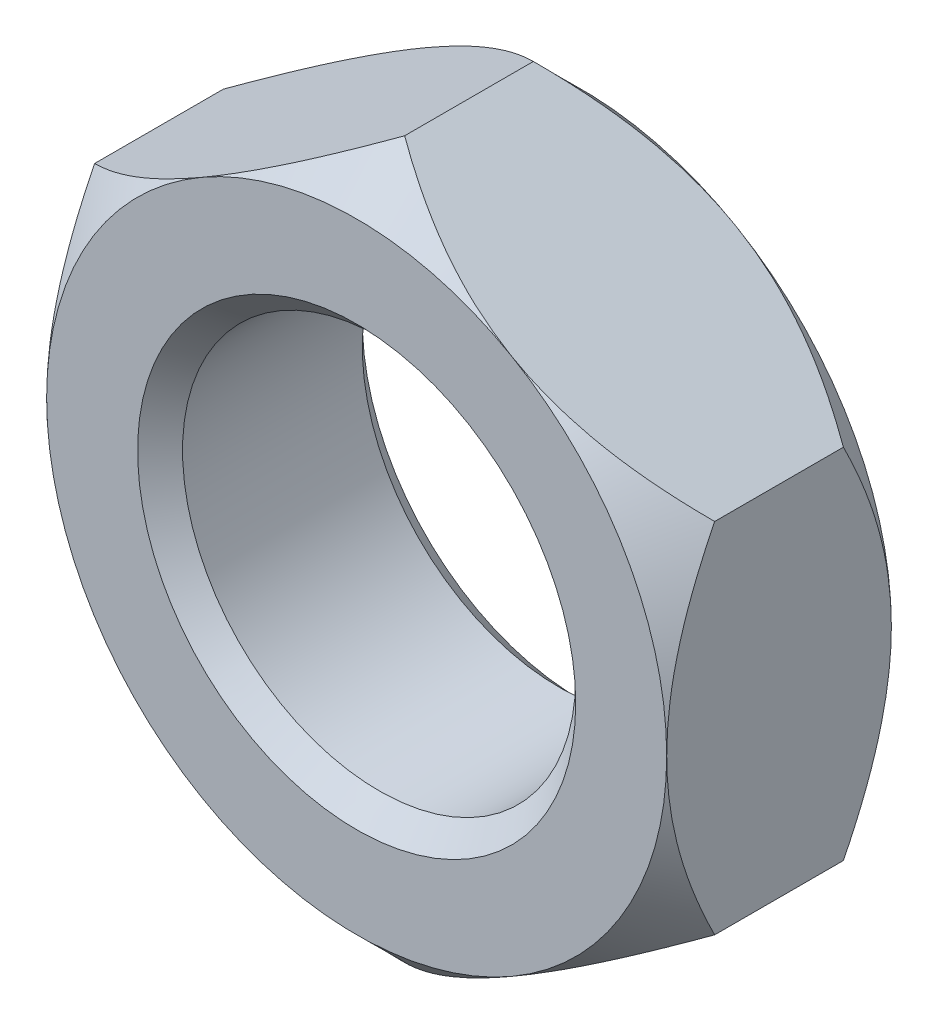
ISO-10303-21;
HEADER;
FILE_DESCRIPTION(('STEP AP214'),'2;1');
FILE_NAME('part.step','',(''),(''),'','','');
FILE_SCHEMA(('AUTOMOTIVE_DESIGN { 1 0 10303 214 1 1 1 1 }'));
ENDSEC;
DATA;
#1=APPLICATION_CONTEXT('core data for automotive mechanical design processes');
#2=APPLICATION_PROTOCOL_DEFINITION('international standard','automotive_design',2000,#1);
#3=PRODUCT_CONTEXT('',#1,'mechanical');
#4=PRODUCT('Part','Part','',(#3));
#5=PRODUCT_RELATED_PRODUCT_CATEGORY('part','',(#4));
#6=PRODUCT_DEFINITION_FORMATION('','',#4);
#7=PRODUCT_DEFINITION_CONTEXT('part definition',#1,'design');
#8=PRODUCT_DEFINITION('design','',#6,#7);
#9=PRODUCT_DEFINITION_SHAPE('','',#8);
#10=(LENGTH_UNIT() NAMED_UNIT(*) SI_UNIT(.MILLI.,.METRE.));
#11=(NAMED_UNIT(*) PLANE_ANGLE_UNIT() SI_UNIT($,.RADIAN.));
#12=(NAMED_UNIT(*) SI_UNIT($,.STERADIAN.) SOLID_ANGLE_UNIT());
#13=UNCERTAINTY_MEASURE_WITH_UNIT(LENGTH_MEASURE(1.E-05),#10,'distance_accuracy_value','');
#14=(GEOMETRIC_REPRESENTATION_CONTEXT(3) GLOBAL_UNCERTAINTY_ASSIGNED_CONTEXT((#13)) GLOBAL_UNIT_ASSIGNED_CONTEXT((#10,
#11,#12)) REPRESENTATION_CONTEXT('',''));
#15=CARTESIAN_POINT('',(0.,0.,0.));
#16=DIRECTION('',(0.,0.,1.));
#17=DIRECTION('',(1.,0.,0.));
#18=AXIS2_PLACEMENT_3D('',#15,#16,#17);
#19=CARTESIAN_POINT('',(-8.763,5.05932040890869,3.175));
#20=DIRECTION('',(0.5,-0.866025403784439,0.));
#21=DIRECTION('',(0.866025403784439,0.5,0.));
#22=AXIS2_PLACEMENT_3D('',#19,#20,#21);
#23=PLANE('',#22);
#24=CARTESIAN_POINT('',(-8.7632,5.05920493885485,-1.81924371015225));
#25=CARTESIAN_POINT('',(-8.61254317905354,5.14618669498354,-1.90621342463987));
#26=CARTESIAN_POINT('',(-8.46070646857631,5.23384966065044,-1.99052931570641));
#27=CARTESIAN_POINT('',(-8.15448960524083,5.41064404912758,-2.15301045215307));
#28=CARTESIAN_POINT('',(-8.00010811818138,5.49977624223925,-2.23117233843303));
#29=CARTESIAN_POINT('',(-7.6878898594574,5.68003553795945,-2.38083349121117));
#30=CARTESIAN_POINT('',(-7.53003836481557,5.7711711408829,-2.45229204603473));
#31=CARTESIAN_POINT('',(-7.21174270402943,5.95493922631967,-2.58699450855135));
#32=CARTESIAN_POINT('',(-7.05129893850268,6.04757147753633,-2.65023967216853));
#33=CARTESIAN_POINT('',(-6.73039844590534,6.23284346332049,-2.76651424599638));
#34=CARTESIAN_POINT('',(-6.56998115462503,6.32546042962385,-2.81968793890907));
#35=CARTESIAN_POINT('',(-6.24689778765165,6.51199269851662,-2.91595405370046));
#36=CARTESIAN_POINT('',(-6.08423195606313,6.60590786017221,-2.95904756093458));
#37=CARTESIAN_POINT('',(-5.75734728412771,6.79463481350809,-3.03406837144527));
#38=CARTESIAN_POINT('',(-5.59313280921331,6.88944408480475,-3.06602080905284));
#39=CARTESIAN_POINT('',(-5.26332521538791,7.07985858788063,-3.11805736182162));
#40=CARTESIAN_POINT('',(-5.09773230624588,7.17546369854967,-3.13814325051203));
#41=CARTESIAN_POINT('',(-4.69419774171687,7.40844448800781,-3.17182153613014));
#42=CARTESIAN_POINT('',(-4.45581992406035,7.54607198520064,-3.1788889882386));
#43=CARTESIAN_POINT('',(-3.97949539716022,7.82107807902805,-3.16702699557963));
#44=CARTESIAN_POINT('',(-3.74154886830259,7.95845657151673,-3.14808843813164));
#45=CARTESIAN_POINT('',(-3.26789880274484,8.23191856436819,-3.08533228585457));
#46=CARTESIAN_POINT('',(-3.0321980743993,8.36800044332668,-3.04148687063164));
#47=CARTESIAN_POINT('',(-2.56484785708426,8.63782521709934,-2.93130030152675));
#48=CARTESIAN_POINT('',(-2.33319805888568,8.77156829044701,-2.86496087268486));
#49=CARTESIAN_POINT('',(-1.9219865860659,9.00898134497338,-2.72848329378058));
#50=CARTESIAN_POINT('',(-1.74151420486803,9.11317712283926,-2.6619350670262));
#51=CARTESIAN_POINT('',(-1.38380898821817,9.31969832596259,-2.51811504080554));
#52=CARTESIAN_POINT('',(-1.20657625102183,9.42202369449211,-2.44084291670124));
#53=CARTESIAN_POINT('',(-0.85590855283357,9.62448178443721,-2.27730713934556));
#54=CARTESIAN_POINT('',(-0.682463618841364,9.72462026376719,-2.19107176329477));
#55=CARTESIAN_POINT('',(-0.338785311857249,9.9230430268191,-2.01074154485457));
#56=CARTESIAN_POINT('',(-0.168550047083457,10.0213284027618,-1.91665152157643));
#57=CARTESIAN_POINT('',(0.000200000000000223,10.1187562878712,-1.81924371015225));
#58=B_SPLINE_CURVE_WITH_KNOTS('',3,(#24,#25,#26,#27,#28,#29,#30,#31,#32,#33,#34,#35,#36,#37,#38,
#39,#40,#41,#42,#43,#44,#45,#46,#47,#48,#49,#50,#51,#52,#53,#54,#55,#56,#57),.UNSPECIFIED.,.F.,
.F.,(4,2,2,2,2,2,2,2,2,2,2,2,2,2,2,2,4),(0.,0.583499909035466,1.16731613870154,1.75447520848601,
2.3415443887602,2.91943332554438,3.49726001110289,4.07377455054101,4.65020290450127,
5.47495261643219,6.29999139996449,7.12595355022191,7.95185237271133,8.60782290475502,
9.26381329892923,9.91779361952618,10.5713756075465),.UNSPECIFIED.);
#59=CARTESIAN_POINT('',(-8.763,5.05932040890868,-1.81935918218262));
#60=VERTEX_POINT('',#59);
#61=CARTESIAN_POINT('',(-4.3815,7.58898061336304,-3.175));
#62=VERTEX_POINT('',#61);
#63=EDGE_CURVE('E48',#60,#62,#58,.T.);
#64=ORIENTED_EDGE('',*,*,#63,.F.);
#65=DIRECTION('',(0.,0.,-1.));
#66=VECTOR('',#65,1.);
#67=CARTESIAN_POINT('',(-8.763,5.05932040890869,3.175));
#68=LINE('',#67,#66);
#69=CARTESIAN_POINT('',(-8.763,5.05932040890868,1.81935918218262));
#70=VERTEX_POINT('',#69);
#71=EDGE_CURVE('E166',#70,#60,#68,.T.);
#72=ORIENTED_EDGE('',*,*,#71,.F.);
#73=CARTESIAN_POINT('',(0.0002,10.1187562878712,1.81924371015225));
#74=CARTESIAN_POINT('',(-0.150456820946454,10.0317745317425,1.90621342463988));
#75=CARTESIAN_POINT('',(-0.302293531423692,9.94411156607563,1.99052931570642));
#76=CARTESIAN_POINT('',(-0.608510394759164,9.76731717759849,2.15301045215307));
#77=CARTESIAN_POINT('',(-0.762891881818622,9.67818498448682,2.23117233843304));
#78=CARTESIAN_POINT('',(-1.07511014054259,9.49792568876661,2.38083349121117));
#79=CARTESIAN_POINT('',(-1.23296163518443,9.40679008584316,2.45229204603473));
#80=CARTESIAN_POINT('',(-1.55125729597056,9.2230220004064,2.58699450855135));
#81=CARTESIAN_POINT('',(-1.71170106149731,9.13038974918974,2.65023967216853));
#82=CARTESIAN_POINT('',(-2.03260155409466,8.94511776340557,2.76651424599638));
#83=CARTESIAN_POINT('',(-2.19301884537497,8.85250079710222,2.81968793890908));
#84=CARTESIAN_POINT('',(-2.51610221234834,8.66596852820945,2.91595405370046));
#85=CARTESIAN_POINT('',(-2.67876804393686,8.57205336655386,2.95904756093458));
#86=CARTESIAN_POINT('',(-3.00565271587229,8.38332641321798,3.03406837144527));
#87=CARTESIAN_POINT('',(-3.16986719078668,8.28851714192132,3.06602080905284));
#88=CARTESIAN_POINT('',(-3.49967478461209,8.09810263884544,3.11805736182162));
#89=CARTESIAN_POINT('',(-3.66526769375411,8.0024975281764,3.13814325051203));
#90=CARTESIAN_POINT('',(-4.06880225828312,7.76951673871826,3.17182153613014));
#91=CARTESIAN_POINT('',(-4.30718007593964,7.63188924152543,3.1788889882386));
#92=CARTESIAN_POINT('',(-4.78350460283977,7.35688314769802,3.16702699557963));
#93=CARTESIAN_POINT('',(-5.0214511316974,7.21950465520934,3.14808843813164));
#94=CARTESIAN_POINT('',(-5.49510119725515,6.94604266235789,3.08533228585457));
#95=CARTESIAN_POINT('',(-5.73080192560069,6.8099607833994,3.04148687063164));
#96=CARTESIAN_POINT('',(-6.19815214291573,6.54013600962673,2.93130030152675));
#97=CARTESIAN_POINT('',(-6.42980194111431,6.40639293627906,2.86496087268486));
#98=CARTESIAN_POINT('',(-6.8410134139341,6.16897988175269,2.72848329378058));
#99=CARTESIAN_POINT('',(-7.02148579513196,6.06478410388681,2.6619350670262));
#100=CARTESIAN_POINT('',(-7.37919101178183,5.85826290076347,2.51811504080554));
#101=CARTESIAN_POINT('',(-7.55642374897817,5.75593753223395,2.44084291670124));
#102=CARTESIAN_POINT('',(-7.90709144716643,5.55347944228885,2.27730713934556));
#103=CARTESIAN_POINT('',(-8.08053638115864,5.45334096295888,2.19107176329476));
#104=CARTESIAN_POINT('',(-8.42421468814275,5.25491819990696,2.01074154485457));
#105=CARTESIAN_POINT('',(-8.59444995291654,5.15663282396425,1.91665152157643));
#106=CARTESIAN_POINT('',(-8.7632,5.05920493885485,1.81924371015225));
#107=B_SPLINE_CURVE_WITH_KNOTS('',3,(#73,#74,#75,#76,#77,#78,#79,#80,#81,#82,#83,#84,#85,#86,
#87,#88,#89,#90,#91,#92,#93,#94,#95,#96,#97,#98,#99,#100,#101,#102,#103,#104,#105,#106),
.UNSPECIFIED.,.F.,.F.,(4,2,2,2,2,2,2,2,2,2,2,2,2,2,2,2,4),(0.,0.583499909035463,
1.16731613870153,1.754475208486,2.34154438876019,2.91943332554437,3.49726001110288,
4.073774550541,4.65020290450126,5.47495261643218,6.29999139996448,7.1259535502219,
7.95185237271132,8.60782290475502,9.26381329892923,9.91779361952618,10.5713756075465),.UNSPECIFIED.);
#108=CARTESIAN_POINT('',(-4.3815,7.58898061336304,3.175));
#109=VERTEX_POINT('',#108);
#110=EDGE_CURVE('E212',#109,#70,#107,.T.);
#111=ORIENTED_EDGE('',*,*,#110,.F.);
#112=CARTESIAN_POINT('',(0.,10.1186408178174,1.81935918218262));
#113=VERTEX_POINT('',#112);
#114=EDGE_CURVE('E157',#113,#109,#107,.T.);
#115=ORIENTED_EDGE('',*,*,#114,.F.);
#116=DIRECTION('',(0.,0.,-1.));
#117=VECTOR('',#116,1.);
#118=CARTESIAN_POINT('',(0.,10.1186408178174,3.175));
#119=LINE('',#118,#117);
#120=CARTESIAN_POINT('',(0.,10.1186408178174,-1.81935918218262));
#121=VERTEX_POINT('',#120);
#122=EDGE_CURVE('E152',#113,#121,#119,.T.);
#123=ORIENTED_EDGE('',*,*,#122,.T.);
#124=EDGE_CURVE('E144',#62,#121,#58,.T.);
#125=ORIENTED_EDGE('',*,*,#124,.F.);
#126=EDGE_LOOP('',(#64,#72,#111,#115,#123,#125));
#127=FACE_BOUND('',#126,.T.);
#128=ADVANCED_FACE('F33',(#127),#23,.F.);
#129=CARTESIAN_POINT('',(-8.763,-5.05932040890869,3.175));
#130=DIRECTION('',(1.,0.,0.));
#131=DIRECTION('',(0.,0.,-1.));
#132=AXIS2_PLACEMENT_3D('',#129,#130,#131);
#133=PLANE('',#132);
#134=CARTESIAN_POINT('',(-8.763,-10.5583847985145,1.78313911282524));
#135=CARTESIAN_POINT('',(-8.763,-10.3032991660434,1.58689538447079));
#136=CARTESIAN_POINT('',(-8.763,-10.0468390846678,1.39241014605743));
#137=CARTESIAN_POINT('',(-8.763,-9.5306082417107,1.0077600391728));
#138=CARTESIAN_POINT('',(-8.763,-9.27083671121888,0.817596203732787));
#139=CARTESIAN_POINT('',(-8.763,-8.74552285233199,0.441039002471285));
#140=CARTESIAN_POINT('',(-8.763,-8.47995146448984,0.254686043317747));
#141=CARTESIAN_POINT('',(-8.763,-7.94438880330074,-0.111534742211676));
#142=CARTESIAN_POINT('',(-8.763,-7.67439783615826,-0.291403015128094));
#143=CARTESIAN_POINT('',(-8.763,-7.1119687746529,-0.654330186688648));
#144=CARTESIAN_POINT('',(-8.763,-6.81919287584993,-0.836868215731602));
#145=CARTESIAN_POINT('',(-8.763,-6.226765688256,-1.19061442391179));
#146=CARTESIAN_POINT('',(-8.763,-5.92711325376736,-1.36182069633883));
#147=CARTESIAN_POINT('',(-8.763,-5.32085102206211,-1.68925731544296));
#148=CARTESIAN_POINT('',(-8.763,-5.01426515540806,-1.84553162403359));
#149=CARTESIAN_POINT('',(-8.763,-4.39242653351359,-2.13960302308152));
#150=CARTESIAN_POINT('',(-8.763,-4.07717795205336,-2.27740883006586));
#151=CARTESIAN_POINT('',(-8.763,-3.46889694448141,-2.51710624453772));
#152=CARTESIAN_POINT('',(-8.763,-3.1767411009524,-2.62119974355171));
#153=CARTESIAN_POINT('',(-8.763,-2.5849861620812,-2.80600146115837));
#154=CARTESIAN_POINT('',(-8.763,-2.28538659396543,-2.88670819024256));
#155=CARTESIAN_POINT('',(-8.763,-1.68575150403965,-3.01902253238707));
#156=CARTESIAN_POINT('',(-8.763,-1.38583459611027,-3.07115865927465));
#157=CARTESIAN_POINT('',(-8.763,-0.782274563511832,-3.14524414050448));
#158=CARTESIAN_POINT('',(-8.763,-0.478632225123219,-3.16719975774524));
#159=CARTESIAN_POINT('',(-8.763,0.116001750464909,-3.17905399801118));
#160=CARTESIAN_POINT('',(-8.763,0.406966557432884,-3.1703111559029));
#161=CARTESIAN_POINT('',(-8.763,0.986625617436,-3.12436991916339));
#162=CARTESIAN_POINT('',(-8.763,1.27531966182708,-3.08716893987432));
#163=CARTESIAN_POINT('',(-8.763,1.8532405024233,-2.9857825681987));
#164=CARTESIAN_POINT('',(-8.763,2.1423822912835,-2.92112076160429));
#165=CARTESIAN_POINT('',(-8.763,2.71429845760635,-2.76840008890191));
#166=CARTESIAN_POINT('',(-8.763,2.99707319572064,-2.68034255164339));
#167=CARTESIAN_POINT('',(-8.763,3.57183355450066,-2.47906113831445));
#168=CARTESIAN_POINT('',(-8.763,3.86340851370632,-2.36467789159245));
#169=CARTESIAN_POINT('',(-8.763,4.4390585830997,-2.1182399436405));
#170=CARTESIAN_POINT('',(-8.763,4.72313024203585,-1.98617727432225));
#171=CARTESIAN_POINT('',(-8.763,5.28511525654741,-1.70751231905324));
#172=CARTESIAN_POINT('',(-8.763,5.56300622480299,-1.560865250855));
#173=CARTESIAN_POINT('',(-8.763,6.11242042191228,-1.25625863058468));
#174=CARTESIAN_POINT('',(-8.763,6.38394462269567,-1.09830082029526));
#175=CARTESIAN_POINT('',(-8.763,6.90818697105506,-0.781305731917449));
#176=CARTESIAN_POINT('',(-8.763,7.16117166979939,-0.622706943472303));
#177=CARTESIAN_POINT('',(-8.763,7.66279459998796,-0.298758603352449));
#178=CARTESIAN_POINT('',(-8.763,7.9114325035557,-0.133408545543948));
#179=CARTESIAN_POINT('',(-8.763,8.40293150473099,0.201492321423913));
#180=CARTESIAN_POINT('',(-8.763,8.64582295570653,0.370998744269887));
#181=CARTESIAN_POINT('',(-8.763,9.12827371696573,0.714555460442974));
#182=CARTESIAN_POINT('',(-8.763,9.36783392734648,0.888604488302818));
#183=CARTESIAN_POINT('',(-8.763,9.60599673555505,1.06451292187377));
#184=B_SPLINE_CURVE_WITH_KNOTS('',3,(#134,#135,#136,#137,#138,#139,#140,#141,#142,#143,#144,
#145,#146,#147,#148,#149,#150,#151,#152,#153,#154,#155,#156,#157,#158,#159,#160,#161,#162,#163,
#164,#165,#166,#167,#168,#169,#170,#171,#172,#173,#174,#175,#176,#177,#178,#179,#180,#181,#182,
#183),.UNSPECIFIED.,.F.,.F.,(4,2,2,2,2,2,2,2,2,2,2,2,2,2,2,2,2,2,2,2,2,2,2,2,4),(0.,
0.965534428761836,1.93129729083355,2.90451082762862,3.87765721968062,4.91250922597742,
5.94753491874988,6.97941284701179,8.01080203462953,8.94043789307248,9.87013294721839,
10.7819934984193,11.6936647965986,12.5655089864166,13.4374323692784,14.3251438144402,
15.2128048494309,16.1517100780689,17.0910399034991,18.0333486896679,18.9755126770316,
19.8711512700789,20.7668571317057,21.6553714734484,22.5436408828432),.UNSPECIFIED.);
#185=CARTESIAN_POINT('',(-8.76299999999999,-5.0593204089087,-1.81935918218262));
#186=VERTEX_POINT('',#185);
#187=CARTESIAN_POINT('',(-8.763,0.,-3.175));
#188=VERTEX_POINT('',#187);
#189=EDGE_CURVE('E56',#186,#188,#184,.T.);
#190=ORIENTED_EDGE('',*,*,#189,.F.);
#191=DIRECTION('',(0.,0.,-1.));
#192=VECTOR('',#191,1.);
#193=CARTESIAN_POINT('',(-8.763,-5.05932040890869,3.175));
#194=LINE('',#193,#192);
#195=CARTESIAN_POINT('',(-8.76299999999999,-5.0593204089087,1.81935918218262));
#196=VERTEX_POINT('',#195);
#197=EDGE_CURVE('E163',#196,#186,#194,.T.);
#198=ORIENTED_EDGE('',*,*,#197,.F.);
#199=CARTESIAN_POINT('',(-8.763,-10.5583847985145,-1.78313911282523));
#200=CARTESIAN_POINT('',(-8.763,-10.3032991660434,-1.58689538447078));
#201=CARTESIAN_POINT('',(-8.763,-10.0468390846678,-1.39241014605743));
#202=CARTESIAN_POINT('',(-8.763,-9.5306082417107,-1.00776003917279));
#203=CARTESIAN_POINT('',(-8.763,-9.27083671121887,-0.817596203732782));
#204=CARTESIAN_POINT('',(-8.763,-8.74552285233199,-0.441039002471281));
#205=CARTESIAN_POINT('',(-8.763,-8.47995146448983,-0.254686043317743));
#206=CARTESIAN_POINT('',(-8.763,-7.94438880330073,0.111534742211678));
#207=CARTESIAN_POINT('',(-8.763,-7.67439783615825,0.291403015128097));
#208=CARTESIAN_POINT('',(-8.763,-7.1119687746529,0.654330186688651));
#209=CARTESIAN_POINT('',(-8.763,-6.81919287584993,0.836868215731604));
#210=CARTESIAN_POINT('',(-8.763,-6.226765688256,1.19061442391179));
#211=CARTESIAN_POINT('',(-8.763,-5.92711325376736,1.36182069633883));
#212=CARTESIAN_POINT('',(-8.763,-5.3208510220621,1.68925731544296));
#213=CARTESIAN_POINT('',(-8.763,-5.01426515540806,1.84553162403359));
#214=CARTESIAN_POINT('',(-8.763,-4.39242653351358,2.13960302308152));
#215=CARTESIAN_POINT('',(-8.763,-4.07717795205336,2.27740883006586));
#216=CARTESIAN_POINT('',(-8.763,-3.46889694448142,2.51710624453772));
#217=CARTESIAN_POINT('',(-8.763,-3.1767411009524,2.62119974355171));
#218=CARTESIAN_POINT('',(-8.763,-2.5849861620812,2.80600146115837));
#219=CARTESIAN_POINT('',(-8.763,-2.28538659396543,2.88670819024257));
#220=CARTESIAN_POINT('',(-8.763,-1.68575150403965,3.01902253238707));
#221=CARTESIAN_POINT('',(-8.763,-1.38583459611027,3.07115865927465));
#222=CARTESIAN_POINT('',(-8.763,-0.782274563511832,3.14524414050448));
#223=CARTESIAN_POINT('',(-8.763,-0.478632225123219,3.16719975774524));
#224=CARTESIAN_POINT('',(-8.763,0.11600175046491,3.17905399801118));
#225=CARTESIAN_POINT('',(-8.763,0.406966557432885,3.1703111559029));
#226=CARTESIAN_POINT('',(-8.763,0.986625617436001,3.12436991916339));
#227=CARTESIAN_POINT('',(-8.763,1.27531966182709,3.08716893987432));
#228=CARTESIAN_POINT('',(-8.763,1.85324050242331,2.9857825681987));
#229=CARTESIAN_POINT('',(-8.763,2.14238229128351,2.9211207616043));
#230=CARTESIAN_POINT('',(-8.763,2.71429845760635,2.76840008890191));
#231=CARTESIAN_POINT('',(-8.763,2.99707319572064,2.68034255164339));
#232=CARTESIAN_POINT('',(-8.763,3.57183355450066,2.47906113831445));
#233=CARTESIAN_POINT('',(-8.763,3.86340851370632,2.36467789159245));
#234=CARTESIAN_POINT('',(-8.763,4.4390585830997,2.1182399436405));
#235=CARTESIAN_POINT('',(-8.763,4.72313024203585,1.98617727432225));
#236=CARTESIAN_POINT('',(-8.763,5.2851152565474,1.70751231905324));
#237=CARTESIAN_POINT('',(-8.763,5.56300622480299,1.560865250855));
#238=CARTESIAN_POINT('',(-8.763,6.11242042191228,1.25625863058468));
#239=CARTESIAN_POINT('',(-8.763,6.38394462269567,1.09830082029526));
#240=CARTESIAN_POINT('',(-8.763,6.90818697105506,0.78130573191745));
#241=CARTESIAN_POINT('',(-8.763,7.16117166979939,0.622706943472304));
#242=CARTESIAN_POINT('',(-8.763,7.66279459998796,0.298758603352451));
#243=CARTESIAN_POINT('',(-8.763,7.9114325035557,0.13340854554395));
#244=CARTESIAN_POINT('',(-8.763,8.40293150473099,-0.201492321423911));
#245=CARTESIAN_POINT('',(-8.763,8.64582295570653,-0.370998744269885));
#246=CARTESIAN_POINT('',(-8.763,9.12827371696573,-0.714555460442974));
#247=CARTESIAN_POINT('',(-8.763,9.36783392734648,-0.888604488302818));
#248=CARTESIAN_POINT('',(-8.763,9.60599673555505,-1.06451292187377));
#249=B_SPLINE_CURVE_WITH_KNOTS('',3,(#199,#200,#201,#202,#203,#204,#205,#206,#207,#208,#209,
#210,#211,#212,#213,#214,#215,#216,#217,#218,#219,#220,#221,#222,#223,#224,#225,#226,#227,#228,
#229,#230,#231,#232,#233,#234,#235,#236,#237,#238,#239,#240,#241,#242,#243,#244,#245,#246,#247,
#248),.UNSPECIFIED.,.F.,.F.,(4,2,2,2,2,2,2,2,2,2,2,2,2,2,2,2,2,2,2,2,2,2,2,2,4),(0.,
0.965534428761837,1.93129729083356,2.90451082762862,3.87765721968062,4.91250922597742,
5.94753491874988,6.97941284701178,8.01080203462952,8.94043789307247,9.87013294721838,
10.7819934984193,11.6936647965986,12.5655089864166,13.4374323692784,14.3251438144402,
15.2128048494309,16.1517100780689,17.0910399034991,18.0333486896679,18.9755126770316,
19.8711512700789,20.7668571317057,21.6553714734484,22.5436408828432),.UNSPECIFIED.);
#250=CARTESIAN_POINT('',(-8.763,0.,3.175));
#251=VERTEX_POINT('',#250);
#252=EDGE_CURVE('E287',#251,#196,#249,.F.);
#253=ORIENTED_EDGE('',*,*,#252,.F.);
#254=EDGE_CURVE('E291',#70,#251,#249,.F.);
#255=ORIENTED_EDGE('',*,*,#254,.F.);
#256=ORIENTED_EDGE('',*,*,#71,.T.);
#257=EDGE_CURVE('E255',#188,#60,#184,.T.);
#258=ORIENTED_EDGE('',*,*,#257,.F.);
#259=EDGE_LOOP('',(#190,#198,#253,#255,#256,#258));
#260=FACE_BOUND('',#259,.T.);
#261=ADVANCED_FACE('F199',(#260),#133,.F.);
#262=CARTESIAN_POINT('',(0.,-10.1186408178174,3.175));
#263=DIRECTION('',(0.5,0.866025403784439,0.));
#264=DIRECTION('',(-0.866025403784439,0.5,0.));
#265=AXIS2_PLACEMENT_3D('',#262,#263,#264);
#266=PLANE('',#265);
#267=CARTESIAN_POINT('',(0.000200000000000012,-10.1187562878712,-1.81924371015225));
#268=CARTESIAN_POINT('',(-0.150456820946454,-10.0317745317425,-1.90621342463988));
#269=CARTESIAN_POINT('',(-0.302293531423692,-9.94411156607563,-1.99052931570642));
#270=CARTESIAN_POINT('',(-0.608510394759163,-9.76731717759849,-2.15301045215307));
#271=CARTESIAN_POINT('',(-0.762891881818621,-9.67818498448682,-2.23117233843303));
#272=CARTESIAN_POINT('',(-1.07511014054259,-9.49792568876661,-2.38083349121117));
#273=CARTESIAN_POINT('',(-1.23296163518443,-9.40679008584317,-2.45229204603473));
#274=CARTESIAN_POINT('',(-1.55125729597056,-9.2230220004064,-2.58699450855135));
#275=CARTESIAN_POINT('',(-1.71170106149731,-9.13038974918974,-2.65023967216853));
#276=CARTESIAN_POINT('',(-2.03260155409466,-8.94511776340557,-2.76651424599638));
#277=CARTESIAN_POINT('',(-2.19301884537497,-8.85250079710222,-2.81968793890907));
#278=CARTESIAN_POINT('',(-2.51610221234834,-8.66596852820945,-2.91595405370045));
#279=CARTESIAN_POINT('',(-2.67876804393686,-8.57205336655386,-2.95904756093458));
#280=CARTESIAN_POINT('',(-3.00565271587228,-8.38332641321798,-3.03406837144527));
#281=CARTESIAN_POINT('',(-3.16986719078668,-8.28851714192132,-3.06602080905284));
#282=CARTESIAN_POINT('',(-3.49967478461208,-8.09810263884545,-3.11805736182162));
#283=CARTESIAN_POINT('',(-3.66526769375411,-8.0024975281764,-3.13814325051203));
#284=CARTESIAN_POINT('',(-4.06880225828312,-7.76951673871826,-3.17182153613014));
#285=CARTESIAN_POINT('',(-4.30718007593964,-7.63188924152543,-3.1788889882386));
#286=CARTESIAN_POINT('',(-4.78350460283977,-7.35688314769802,-3.16702699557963));
#287=CARTESIAN_POINT('',(-5.02145113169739,-7.21950465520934,-3.14808843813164));
#288=CARTESIAN_POINT('',(-5.49510119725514,-6.94604266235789,-3.08533228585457));
#289=CARTESIAN_POINT('',(-5.73080192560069,-6.8099607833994,-3.04148687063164));
#290=CARTESIAN_POINT('',(-6.19815214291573,-6.54013600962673,-2.93130030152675));
#291=CARTESIAN_POINT('',(-6.42980194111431,-6.40639293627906,-2.86496087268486));
#292=CARTESIAN_POINT('',(-6.84101341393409,-6.16897988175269,-2.72848329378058));
#293=CARTESIAN_POINT('',(-7.02148579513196,-6.06478410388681,-2.6619350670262));
#294=CARTESIAN_POINT('',(-7.37919101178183,-5.85826290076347,-2.51811504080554));
#295=CARTESIAN_POINT('',(-7.55642374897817,-5.75593753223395,-2.44084291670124));
#296=CARTESIAN_POINT('',(-7.90709144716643,-5.55347944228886,-2.27730713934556));
#297=CARTESIAN_POINT('',(-8.08053638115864,-5.45334096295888,-2.19107176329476));
#298=CARTESIAN_POINT('',(-8.42421468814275,-5.25491819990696,-2.01074154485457));
#299=CARTESIAN_POINT('',(-8.59444995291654,-5.15663282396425,-1.91665152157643));
#300=CARTESIAN_POINT('',(-8.7632,-5.05920493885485,-1.81924371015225));
#301=B_SPLINE_CURVE_WITH_KNOTS('',3,(#267,#268,#269,#270,#271,#272,#273,#274,#275,#276,#277,
#278,#279,#280,#281,#282,#283,#284,#285,#286,#287,#288,#289,#290,#291,#292,#293,#294,#295,#296,
#297,#298,#299,#300),.UNSPECIFIED.,.F.,.F.,(4,2,2,2,2,2,2,2,2,2,2,2,2,2,2,2,4),(0.,
0.583499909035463,1.16731613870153,1.754475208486,2.34154438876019,2.91943332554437,
3.49726001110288,4.073774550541,4.65020290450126,5.47495261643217,6.29999139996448,
7.1259535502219,7.95185237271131,8.60782290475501,9.26381329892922,9.91779361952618,
10.5713756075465),.UNSPECIFIED.);
#302=CARTESIAN_POINT('',(0.,-10.1186408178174,-1.81935918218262));
#303=VERTEX_POINT('',#302);
#304=CARTESIAN_POINT('',(-4.3815,-7.58898061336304,-3.175));
#305=VERTEX_POINT('',#304);
#306=EDGE_CURVE('E264',#303,#305,#301,.T.);
#307=ORIENTED_EDGE('',*,*,#306,.F.);
#308=DIRECTION('',(0.,0.,-1.));
#309=VECTOR('',#308,1.);
#310=CARTESIAN_POINT('',(0.,-10.1186408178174,3.175));
#311=LINE('',#310,#309);
#312=CARTESIAN_POINT('',(0.,-10.1186408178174,1.81935918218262));
#313=VERTEX_POINT('',#312);
#314=EDGE_CURVE('E154',#313,#303,#311,.T.);
#315=ORIENTED_EDGE('',*,*,#314,.F.);
#316=CARTESIAN_POINT('',(-8.7632,-5.05920493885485,1.81924371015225));
#317=CARTESIAN_POINT('',(-8.61254317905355,-5.14618669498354,1.90621342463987));
#318=CARTESIAN_POINT('',(-8.46070646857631,-5.23384966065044,1.99052931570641));
#319=CARTESIAN_POINT('',(-8.15448960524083,-5.41064404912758,2.15301045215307));
#320=CARTESIAN_POINT('',(-8.00010811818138,-5.49977624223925,2.23117233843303));
#321=CARTESIAN_POINT('',(-7.6878898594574,-5.68003553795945,2.38083349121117));
#322=CARTESIAN_POINT('',(-7.53003836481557,-5.7711711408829,2.45229204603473));
#323=CARTESIAN_POINT('',(-7.21174270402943,-5.95493922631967,2.58699450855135));
#324=CARTESIAN_POINT('',(-7.05129893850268,-6.04757147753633,2.65023967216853));
#325=CARTESIAN_POINT('',(-6.73039844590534,-6.23284346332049,2.76651424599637));
#326=CARTESIAN_POINT('',(-6.56998115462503,-6.32546042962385,2.81968793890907));
#327=CARTESIAN_POINT('',(-6.24689778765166,-6.51199269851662,2.91595405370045));
#328=CARTESIAN_POINT('',(-6.08423195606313,-6.60590786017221,2.95904756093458));
#329=CARTESIAN_POINT('',(-5.75734728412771,-6.79463481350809,3.03406837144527));
#330=CARTESIAN_POINT('',(-5.59313280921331,-6.88944408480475,3.06602080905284));
#331=CARTESIAN_POINT('',(-5.26332521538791,-7.07985858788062,3.11805736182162));
#332=CARTESIAN_POINT('',(-5.09773230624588,-7.17546369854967,3.13814325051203));
#333=CARTESIAN_POINT('',(-4.69419774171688,-7.40844448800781,3.17182153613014));
#334=CARTESIAN_POINT('',(-4.45581992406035,-7.54607198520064,3.1788889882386));
#335=CARTESIAN_POINT('',(-3.97949539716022,-7.82107807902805,3.16702699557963));
#336=CARTESIAN_POINT('',(-3.7415488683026,-7.95845657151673,3.14808843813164));
#337=CARTESIAN_POINT('',(-3.26789880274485,-8.23191856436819,3.08533228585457));
#338=CARTESIAN_POINT('',(-3.03219807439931,-8.36800044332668,3.04148687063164));
#339=CARTESIAN_POINT('',(-2.56484785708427,-8.63782521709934,2.93130030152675));
#340=CARTESIAN_POINT('',(-2.33319805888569,-8.77156829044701,2.86496087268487));
#341=CARTESIAN_POINT('',(-1.9219865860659,-9.00898134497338,2.72848329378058));
#342=CARTESIAN_POINT('',(-1.74151420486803,-9.11317712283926,2.6619350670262));
#343=CARTESIAN_POINT('',(-1.38380898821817,-9.31969832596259,2.51811504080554));
#344=CARTESIAN_POINT('',(-1.20657625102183,-9.42202369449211,2.44084291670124));
#345=CARTESIAN_POINT('',(-0.855908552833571,-9.62448178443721,2.27730713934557));
#346=CARTESIAN_POINT('',(-0.682463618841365,-9.72462026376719,2.19107176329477));
#347=CARTESIAN_POINT('',(-0.33878531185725,-9.9230430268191,2.01074154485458));
#348=CARTESIAN_POINT('',(-0.168550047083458,-10.0213284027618,1.91665152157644));
#349=CARTESIAN_POINT('',(0.000199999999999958,-10.1187562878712,1.81924371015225));
#350=B_SPLINE_CURVE_WITH_KNOTS('',3,(#316,#317,#318,#319,#320,#321,#322,#323,#324,#325,#326,
#327,#328,#329,#330,#331,#332,#333,#334,#335,#336,#337,#338,#339,#340,#341,#342,#343,#344,#345,
#346,#347,#348,#349),.UNSPECIFIED.,.F.,.F.,(4,2,2,2,2,2,2,2,2,2,2,2,2,2,2,2,4),(0.,
0.583499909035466,1.16731613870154,1.75447520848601,2.34154438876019,2.91943332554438,
3.49726001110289,4.07377455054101,4.65020290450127,5.47495261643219,6.29999139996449,
7.12595355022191,7.95185237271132,8.60782290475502,9.26381329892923,9.91779361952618,
10.5713756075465),.UNSPECIFIED.);
#351=CARTESIAN_POINT('',(-4.3815,-7.58898061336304,3.175));
#352=VERTEX_POINT('',#351);
#353=EDGE_CURVE('E275',#352,#313,#350,.T.);
#354=ORIENTED_EDGE('',*,*,#353,.F.);
#355=EDGE_CURVE('E280',#196,#352,#350,.T.);
#356=ORIENTED_EDGE('',*,*,#355,.F.);
#357=ORIENTED_EDGE('',*,*,#197,.T.);
#358=EDGE_CURVE('E259',#305,#186,#301,.T.);
#359=ORIENTED_EDGE('',*,*,#358,.F.);
#360=EDGE_LOOP('',(#307,#315,#354,#356,#357,#359));
#361=FACE_BOUND('',#360,.T.);
#362=ADVANCED_FACE('F205',(#361),#266,.F.);
#363=CARTESIAN_POINT('',(8.763,-5.05932040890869,3.175));
#364=DIRECTION('',(-0.5,0.866025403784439,0.));
#365=DIRECTION('',(-0.866025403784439,-0.5,0.));
#366=AXIS2_PLACEMENT_3D('',#363,#364,#365);
#367=PLANE('',#366);
#368=CARTESIAN_POINT('',(8.7632,-5.05920493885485,-1.81924371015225));
#369=CARTESIAN_POINT('',(8.61254317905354,-5.14618669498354,-1.90621342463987));
#370=CARTESIAN_POINT('',(8.46070646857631,-5.23384966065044,-1.99052931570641));
#371=CARTESIAN_POINT('',(8.15448960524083,-5.41064404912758,-2.15301045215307));
#372=CARTESIAN_POINT('',(8.00010811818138,-5.49977624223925,-2.23117233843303));
#373=CARTESIAN_POINT('',(7.6878898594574,-5.68003553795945,-2.38083349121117));
#374=CARTESIAN_POINT('',(7.53003836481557,-5.7711711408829,-2.45229204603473));
#375=CARTESIAN_POINT('',(7.21174270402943,-5.95493922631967,-2.58699450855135));
#376=CARTESIAN_POINT('',(7.05129893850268,-6.04757147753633,-2.65023967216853));
#377=CARTESIAN_POINT('',(6.73039844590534,-6.23284346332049,-2.76651424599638));
#378=CARTESIAN_POINT('',(6.56998115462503,-6.32546042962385,-2.81968793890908));
#379=CARTESIAN_POINT('',(6.24689778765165,-6.51199269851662,-2.91595405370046));
#380=CARTESIAN_POINT('',(6.08423195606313,-6.60590786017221,-2.95904756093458));
#381=CARTESIAN_POINT('',(5.75734728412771,-6.79463481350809,-3.03406837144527));
#382=CARTESIAN_POINT('',(5.59313280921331,-6.88944408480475,-3.06602080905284));
#383=CARTESIAN_POINT('',(5.26332521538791,-7.07985858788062,-3.11805736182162));
#384=CARTESIAN_POINT('',(5.09773230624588,-7.17546369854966,-3.13814325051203));
#385=CARTESIAN_POINT('',(4.69419774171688,-7.40844448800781,-3.17182153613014));
#386=CARTESIAN_POINT('',(4.45581992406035,-7.54607198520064,-3.1788889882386));
#387=CARTESIAN_POINT('',(3.97949539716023,-7.82107807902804,-3.16702699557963));
#388=CARTESIAN_POINT('',(3.7415488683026,-7.95845657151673,-3.14808843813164));
#389=CARTESIAN_POINT('',(3.26789880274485,-8.23191856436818,-3.08533228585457));
#390=CARTESIAN_POINT('',(3.03219807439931,-8.36800044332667,-3.04148687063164));
#391=CARTESIAN_POINT('',(2.56484785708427,-8.63782521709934,-2.93130030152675));
#392=CARTESIAN_POINT('',(2.33319805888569,-8.77156829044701,-2.86496087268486));
#393=CARTESIAN_POINT('',(1.9219865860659,-9.00898134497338,-2.72848329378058));
#394=CARTESIAN_POINT('',(1.74151420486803,-9.11317712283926,-2.6619350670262));
#395=CARTESIAN_POINT('',(1.38380898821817,-9.31969832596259,-2.51811504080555));
#396=CARTESIAN_POINT('',(1.20657625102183,-9.42202369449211,-2.44084291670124));
#397=CARTESIAN_POINT('',(0.855908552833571,-9.62448178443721,-2.27730713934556));
#398=CARTESIAN_POINT('',(0.682463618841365,-9.72462026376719,-2.19107176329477));
#399=CARTESIAN_POINT('',(0.338785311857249,-9.9230430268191,-2.01074154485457));
#400=CARTESIAN_POINT('',(0.168550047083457,-10.0213284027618,-1.91665152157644));
#401=CARTESIAN_POINT('',(-0.00020000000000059,-10.1187562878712,-1.81924371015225));
#402=B_SPLINE_CURVE_WITH_KNOTS('',3,(#368,#369,#370,#371,#372,#373,#374,#375,#376,#377,#378,
#379,#380,#381,#382,#383,#384,#385,#386,#387,#388,#389,#390,#391,#392,#393,#394,#395,#396,#397,
#398,#399,#400,#401),.UNSPECIFIED.,.F.,.F.,(4,2,2,2,2,2,2,2,2,2,2,2,2,2,2,2,4),(0.,
0.583499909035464,1.16731613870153,1.75447520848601,2.3415443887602,2.91943332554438,
3.49726001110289,4.07377455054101,4.65020290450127,5.47495261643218,6.29999139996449,
7.12595355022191,7.95185237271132,8.60782290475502,9.26381329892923,9.91779361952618,
10.5713756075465),.UNSPECIFIED.);
#403=CARTESIAN_POINT('',(8.763,-5.05932040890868,-1.81935918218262));
#404=VERTEX_POINT('',#403);
#405=CARTESIAN_POINT('',(4.3815,-7.58898061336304,-3.175));
#406=VERTEX_POINT('',#405);
#407=EDGE_CURVE('E228',#404,#406,#402,.T.);
#408=ORIENTED_EDGE('',*,*,#407,.F.);
#409=DIRECTION('',(0.,0.,-1.));
#410=VECTOR('',#409,1.);
#411=CARTESIAN_POINT('',(8.763,-5.05932040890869,3.175));
#412=LINE('',#411,#410);
#413=CARTESIAN_POINT('',(8.763,-5.05932040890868,1.81935918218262));
#414=VERTEX_POINT('',#413);
#415=EDGE_CURVE('E151',#414,#404,#412,.T.);
#416=ORIENTED_EDGE('',*,*,#415,.F.);
#417=CARTESIAN_POINT('',(-0.0002,-10.1187562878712,1.81924371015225));
#418=CARTESIAN_POINT('',(0.150456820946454,-10.0317745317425,1.90621342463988));
#419=CARTESIAN_POINT('',(0.302293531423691,-9.94411156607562,1.99052931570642));
#420=CARTESIAN_POINT('',(0.608510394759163,-9.76731717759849,2.15301045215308));
#421=CARTESIAN_POINT('',(0.762891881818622,-9.67818498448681,2.23117233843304));
#422=CARTESIAN_POINT('',(1.07511014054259,-9.49792568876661,2.38083349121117));
#423=CARTESIAN_POINT('',(1.23296163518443,-9.40679008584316,2.45229204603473));
#424=CARTESIAN_POINT('',(1.55125729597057,-9.2230220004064,2.58699450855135));
#425=CARTESIAN_POINT('',(1.71170106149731,-9.13038974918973,2.65023967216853));
#426=CARTESIAN_POINT('',(2.03260155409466,-8.94511776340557,2.76651424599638));
#427=CARTESIAN_POINT('',(2.19301884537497,-8.85250079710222,2.81968793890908));
#428=CARTESIAN_POINT('',(2.51610221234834,-8.66596852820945,2.91595405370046));
#429=CARTESIAN_POINT('',(2.67876804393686,-8.57205336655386,2.95904756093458));
#430=CARTESIAN_POINT('',(3.00565271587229,-8.38332641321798,3.03406837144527));
#431=CARTESIAN_POINT('',(3.16986719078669,-8.28851714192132,3.06602080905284));
#432=CARTESIAN_POINT('',(3.49967478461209,-8.09810263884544,3.11805736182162));
#433=CARTESIAN_POINT('',(3.66526769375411,-8.0024975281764,3.13814325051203));
#434=CARTESIAN_POINT('',(4.06880225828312,-7.76951673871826,3.17182153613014));
#435=CARTESIAN_POINT('',(4.30718007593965,-7.63188924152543,3.1788889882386));
#436=CARTESIAN_POINT('',(4.78350460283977,-7.35688314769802,3.16702699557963));
#437=CARTESIAN_POINT('',(5.0214511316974,-7.21950465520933,3.14808843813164));
#438=CARTESIAN_POINT('',(5.49510119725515,-6.94604266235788,3.08533228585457));
#439=CARTESIAN_POINT('',(5.73080192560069,-6.80996078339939,3.04148687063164));
#440=CARTESIAN_POINT('',(6.19815214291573,-6.54013600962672,2.93130030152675));
#441=CARTESIAN_POINT('',(6.42980194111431,-6.40639293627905,2.86496087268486));
#442=CARTESIAN_POINT('',(6.8410134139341,-6.16897988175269,2.72848329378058));
#443=CARTESIAN_POINT('',(7.02148579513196,-6.06478410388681,2.6619350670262));
#444=CARTESIAN_POINT('',(7.37919101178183,-5.85826290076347,2.51811504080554));
#445=CARTESIAN_POINT('',(7.55642374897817,-5.75593753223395,2.44084291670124));
#446=CARTESIAN_POINT('',(7.90709144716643,-5.55347944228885,2.27730713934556));
#447=CARTESIAN_POINT('',(8.08053638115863,-5.45334096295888,2.19107176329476));
#448=CARTESIAN_POINT('',(8.42421468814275,-5.25491819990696,2.01074154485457));
#449=CARTESIAN_POINT('',(8.59444995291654,-5.15663282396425,1.91665152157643));
#450=CARTESIAN_POINT('',(8.7632,-5.05920493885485,1.81924371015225));
#451=B_SPLINE_CURVE_WITH_KNOTS('',3,(#417,#418,#419,#420,#421,#422,#423,#424,#425,#426,#427,
#428,#429,#430,#431,#432,#433,#434,#435,#436,#437,#438,#439,#440,#441,#442,#443,#444,#445,#446,
#447,#448,#449,#450),.UNSPECIFIED.,.F.,.F.,(4,2,2,2,2,2,2,2,2,2,2,2,2,2,2,2,4),(0.,
0.583499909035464,1.16731613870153,1.754475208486,2.34154438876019,2.91943332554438,
3.49726001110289,4.073774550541,4.65020290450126,5.47495261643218,6.29999139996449,
7.12595355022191,7.95185237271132,8.60782290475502,9.26381329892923,9.91779361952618,
10.5713756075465),.UNSPECIFIED.);
#452=CARTESIAN_POINT('',(4.3815,-7.58898061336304,3.175));
#453=VERTEX_POINT('',#452);
#454=EDGE_CURVE('E282',#453,#414,#451,.T.);
#455=ORIENTED_EDGE('',*,*,#454,.F.);
#456=EDGE_CURVE('E281',#313,#453,#451,.T.);
#457=ORIENTED_EDGE('',*,*,#456,.F.);
#458=ORIENTED_EDGE('',*,*,#314,.T.);
#459=EDGE_CURVE('E265',#406,#303,#402,.T.);
#460=ORIENTED_EDGE('',*,*,#459,.F.);
#461=EDGE_LOOP('',(#408,#416,#455,#457,#458,#460));
#462=FACE_BOUND('',#461,.T.);
#463=ADVANCED_FACE('F270',(#462),#367,.F.);
#464=CARTESIAN_POINT('',(8.763,5.05932040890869,3.175));
#465=DIRECTION('',(-1.,0.,0.));
#466=DIRECTION('',(0.,-1.,0.));
#467=AXIS2_PLACEMENT_3D('',#464,#465,#466);
#468=PLANE('',#467);
#469=CARTESIAN_POINT('',(8.763,-10.5583847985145,1.78313911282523));
#470=CARTESIAN_POINT('',(8.763,-10.3032991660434,1.58689538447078));
#471=CARTESIAN_POINT('',(8.763,-10.0468390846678,1.39241014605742));
#472=CARTESIAN_POINT('',(8.763,-9.53060824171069,1.00776003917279));
#473=CARTESIAN_POINT('',(8.763,-9.27083671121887,0.817596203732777));
#474=CARTESIAN_POINT('',(8.763,-8.74552285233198,0.441039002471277));
#475=CARTESIAN_POINT('',(8.763,-8.47995146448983,0.25468604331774));
#476=CARTESIAN_POINT('',(8.763,-7.94438880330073,-0.111534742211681));
#477=CARTESIAN_POINT('',(8.763,-7.67439783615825,-0.2914030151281));
#478=CARTESIAN_POINT('',(8.763,-7.1119687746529,-0.654330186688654));
#479=CARTESIAN_POINT('',(8.763,-6.81919287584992,-0.836868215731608));
#480=CARTESIAN_POINT('',(8.763,-6.22676568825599,-1.1906144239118));
#481=CARTESIAN_POINT('',(8.763,-5.92711325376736,-1.36182069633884));
#482=CARTESIAN_POINT('',(8.763,-5.3208510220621,-1.68925731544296));
#483=CARTESIAN_POINT('',(8.763,-5.01426515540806,-1.84553162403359));
#484=CARTESIAN_POINT('',(8.763,-4.39242653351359,-2.13960302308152));
#485=CARTESIAN_POINT('',(8.763,-4.07717795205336,-2.27740883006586));
#486=CARTESIAN_POINT('',(8.763,-3.46889694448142,-2.51710624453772));
#487=CARTESIAN_POINT('',(8.763,-3.1767411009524,-2.62119974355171));
#488=CARTESIAN_POINT('',(8.763,-2.5849861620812,-2.80600146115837));
#489=CARTESIAN_POINT('',(8.763,-2.28538659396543,-2.88670819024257));
#490=CARTESIAN_POINT('',(8.763,-1.68575150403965,-3.01902253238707));
#491=CARTESIAN_POINT('',(8.763,-1.38583459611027,-3.07115865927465));
#492=CARTESIAN_POINT('',(8.763,-0.782274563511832,-3.14524414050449));
#493=CARTESIAN_POINT('',(8.763,-0.478632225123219,-3.16719975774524));
#494=CARTESIAN_POINT('',(8.763,0.11600175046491,-3.17905399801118));
#495=CARTESIAN_POINT('',(8.763,0.406966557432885,-3.1703111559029));
#496=CARTESIAN_POINT('',(8.763,0.986625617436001,-3.12436991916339));
#497=CARTESIAN_POINT('',(8.763,1.27531966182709,-3.08716893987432));
#498=CARTESIAN_POINT('',(8.763,1.85324050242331,-2.9857825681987));
#499=CARTESIAN_POINT('',(8.763,2.14238229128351,-2.9211207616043));
#500=CARTESIAN_POINT('',(8.763,2.71429845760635,-2.76840008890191));
#501=CARTESIAN_POINT('',(8.763,2.99707319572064,-2.68034255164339));
#502=CARTESIAN_POINT('',(8.763,3.57183355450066,-2.47906113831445));
#503=CARTESIAN_POINT('',(8.763,3.86340851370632,-2.36467789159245));
#504=CARTESIAN_POINT('',(8.763,4.4390585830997,-2.1182399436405));
#505=CARTESIAN_POINT('',(8.763,4.72313024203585,-1.98617727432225));
#506=CARTESIAN_POINT('',(8.763,5.28511525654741,-1.70751231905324));
#507=CARTESIAN_POINT('',(8.763,5.563006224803,-1.56086525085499));
#508=CARTESIAN_POINT('',(8.763,6.11242042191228,-1.25625863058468));
#509=CARTESIAN_POINT('',(8.763,6.38394462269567,-1.09830082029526));
#510=CARTESIAN_POINT('',(8.763,6.90818697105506,-0.781305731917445));
#511=CARTESIAN_POINT('',(8.763,7.1611716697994,-0.622706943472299));
#512=CARTESIAN_POINT('',(8.763,7.66279459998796,-0.298758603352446));
#513=CARTESIAN_POINT('',(8.763,7.9114325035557,-0.133408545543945));
#514=CARTESIAN_POINT('',(8.763,8.40293150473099,0.201492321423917));
#515=CARTESIAN_POINT('',(8.763,8.64582295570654,0.370998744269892));
#516=CARTESIAN_POINT('',(8.763,9.12827371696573,0.71455546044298));
#517=CARTESIAN_POINT('',(8.763,9.36783392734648,0.888604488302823));
#518=CARTESIAN_POINT('',(8.763,9.60599673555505,1.06451292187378));
#519=B_SPLINE_CURVE_WITH_KNOTS('',3,(#469,#470,#471,#472,#473,#474,#475,#476,#477,#478,#479,
#480,#481,#482,#483,#484,#485,#486,#487,#488,#489,#490,#491,#492,#493,#494,#495,#496,#497,#498,
#499,#500,#501,#502,#503,#504,#505,#506,#507,#508,#509,#510,#511,#512,#513,#514,#515,#516,#517,
#518),.UNSPECIFIED.,.F.,.F.,(4,2,2,2,2,2,2,2,2,2,2,2,2,2,2,2,2,2,2,2,2,2,2,2,4),(0.,
0.965534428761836,1.93129729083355,2.90451082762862,3.87765721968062,4.91250922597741,
5.94753491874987,6.97941284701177,8.01080203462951,8.94043789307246,9.87013294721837,
10.7819934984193,11.6936647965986,12.5655089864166,13.4374323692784,14.3251438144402,
15.2128048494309,16.1517100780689,17.0910399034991,18.0333486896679,18.9755126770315,
19.8711512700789,20.7668571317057,21.6553714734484,22.5436408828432),.UNSPECIFIED.);
#520=CARTESIAN_POINT('',(8.76299999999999,5.0593204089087,-1.81935918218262));
#521=VERTEX_POINT('',#520);
#522=CARTESIAN_POINT('',(8.763,0.,-3.175));
#523=VERTEX_POINT('',#522);
#524=EDGE_CURVE('E126',#521,#523,#519,.F.);
#525=ORIENTED_EDGE('',*,*,#524,.F.);
#526=DIRECTION('',(0.,0.,-1.));
#527=VECTOR('',#526,1.);
#528=CARTESIAN_POINT('',(8.763,5.05932040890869,3.175));
#529=LINE('',#528,#527);
#530=CARTESIAN_POINT('',(8.76299999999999,5.0593204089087,1.81935918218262));
#531=VERTEX_POINT('',#530);
#532=EDGE_CURVE('E141',#531,#521,#529,.T.);
#533=ORIENTED_EDGE('',*,*,#532,.F.);
#534=CARTESIAN_POINT('',(8.763,-10.5583847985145,-1.78313911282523));
#535=CARTESIAN_POINT('',(8.763,-10.3032991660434,-1.58689538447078));
#536=CARTESIAN_POINT('',(8.763,-10.0468390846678,-1.39241014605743));
#537=CARTESIAN_POINT('',(8.763,-9.5306082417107,-1.00776003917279));
#538=CARTESIAN_POINT('',(8.763,-9.27083671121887,-0.81759620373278));
#539=CARTESIAN_POINT('',(8.763,-8.74552285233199,-0.441039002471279));
#540=CARTESIAN_POINT('',(8.763,-8.47995146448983,-0.254686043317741));
#541=CARTESIAN_POINT('',(8.763,-7.94438880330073,0.111534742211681));
#542=CARTESIAN_POINT('',(8.763,-7.67439783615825,0.2914030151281));
#543=CARTESIAN_POINT('',(8.763,-7.1119687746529,0.654330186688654));
#544=CARTESIAN_POINT('',(8.763,-6.81919287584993,0.836868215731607));
#545=CARTESIAN_POINT('',(8.763,-6.226765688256,1.1906144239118));
#546=CARTESIAN_POINT('',(8.763,-5.92711325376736,1.36182069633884));
#547=CARTESIAN_POINT('',(8.763,-5.3208510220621,1.68925731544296));
#548=CARTESIAN_POINT('',(8.763,-5.01426515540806,1.84553162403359));
#549=CARTESIAN_POINT('',(8.763,-4.39242653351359,2.13960302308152));
#550=CARTESIAN_POINT('',(8.763,-4.07717795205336,2.27740883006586));
#551=CARTESIAN_POINT('',(8.763,-3.46889694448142,2.51710624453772));
#552=CARTESIAN_POINT('',(8.763,-3.1767411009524,2.62119974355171));
#553=CARTESIAN_POINT('',(8.763,-2.5849861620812,2.80600146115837));
#554=CARTESIAN_POINT('',(8.763,-2.28538659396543,2.88670819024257));
#555=CARTESIAN_POINT('',(8.763,-1.68575150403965,3.01902253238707));
#556=CARTESIAN_POINT('',(8.763,-1.38583459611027,3.07115865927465));
#557=CARTESIAN_POINT('',(8.763,-0.782274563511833,3.14524414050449));
#558=CARTESIAN_POINT('',(8.763,-0.47863222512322,3.16719975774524));
#559=CARTESIAN_POINT('',(8.763,0.116001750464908,3.17905399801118));
#560=CARTESIAN_POINT('',(8.763,0.406966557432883,3.1703111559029));
#561=CARTESIAN_POINT('',(8.763,0.986625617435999,3.12436991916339));
#562=CARTESIAN_POINT('',(8.763,1.27531966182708,3.08716893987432));
#563=CARTESIAN_POINT('',(8.763,1.8532405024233,2.9857825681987));
#564=CARTESIAN_POINT('',(8.763,2.1423822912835,2.9211207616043));
#565=CARTESIAN_POINT('',(8.763,2.71429845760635,2.76840008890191));
#566=CARTESIAN_POINT('',(8.763,2.99707319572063,2.68034255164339));
#567=CARTESIAN_POINT('',(8.763,3.57183355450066,2.47906113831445));
#568=CARTESIAN_POINT('',(8.763,3.86340851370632,2.36467789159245));
#569=CARTESIAN_POINT('',(8.763,4.4390585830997,2.1182399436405));
#570=CARTESIAN_POINT('',(8.763,4.72313024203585,1.98617727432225));
#571=CARTESIAN_POINT('',(8.763,5.28511525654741,1.70751231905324));
#572=CARTESIAN_POINT('',(8.763,5.56300622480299,1.560865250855));
#573=CARTESIAN_POINT('',(8.763,6.11242042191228,1.25625863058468));
#574=CARTESIAN_POINT('',(8.763,6.38394462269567,1.09830082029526));
#575=CARTESIAN_POINT('',(8.763,6.90818697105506,0.781305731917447));
#576=CARTESIAN_POINT('',(8.763,7.16117166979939,0.622706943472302));
#577=CARTESIAN_POINT('',(8.763,7.66279459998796,0.298758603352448));
#578=CARTESIAN_POINT('',(8.763,7.9114325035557,0.133408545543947));
#579=CARTESIAN_POINT('',(8.763,8.40293150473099,-0.201492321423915));
#580=CARTESIAN_POINT('',(8.763,8.64582295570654,-0.370998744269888));
#581=CARTESIAN_POINT('',(8.763,9.12827371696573,-0.714555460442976));
#582=CARTESIAN_POINT('',(8.763,9.36783392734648,-0.888604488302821));
#583=CARTESIAN_POINT('',(8.763,9.60599673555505,-1.06451292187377));
#584=B_SPLINE_CURVE_WITH_KNOTS('',3,(#534,#535,#536,#537,#538,#539,#540,#541,#542,#543,#544,
#545,#546,#547,#548,#549,#550,#551,#552,#553,#554,#555,#556,#557,#558,#559,#560,#561,#562,#563,
#564,#565,#566,#567,#568,#569,#570,#571,#572,#573,#574,#575,#576,#577,#578,#579,#580,#581,#582,
#583),.UNSPECIFIED.,.F.,.F.,(4,2,2,2,2,2,2,2,2,2,2,2,2,2,2,2,2,2,2,2,2,2,2,2,4),(0.,
0.965534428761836,1.93129729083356,2.90451082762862,3.87765721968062,4.91250922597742,
5.94753491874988,6.97941284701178,8.01080203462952,8.94043789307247,9.87013294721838,
10.7819934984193,11.6936647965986,12.5655089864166,13.4374323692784,14.3251438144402,
15.2128048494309,16.1517100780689,17.0910399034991,18.0333486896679,18.9755126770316,
19.8711512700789,20.7668571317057,21.6553714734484,22.5436408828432),.UNSPECIFIED.);
#585=CARTESIAN_POINT('',(8.763,0.,3.175));
#586=VERTEX_POINT('',#585);
#587=EDGE_CURVE('E325',#586,#531,#584,.T.);
#588=ORIENTED_EDGE('',*,*,#587,.F.);
#589=EDGE_CURVE('E321',#414,#586,#584,.T.);
#590=ORIENTED_EDGE('',*,*,#589,.F.);
#591=ORIENTED_EDGE('',*,*,#415,.T.);
#592=EDGE_CURVE('E143',#523,#404,#519,.F.);
#593=ORIENTED_EDGE('',*,*,#592,.F.);
#594=EDGE_LOOP('',(#525,#533,#588,#590,#591,#593));
#595=FACE_BOUND('',#594,.T.);
#596=ADVANCED_FACE('F139',(#595),#468,.F.);
#597=CARTESIAN_POINT('',(0.,10.1186408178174,3.175));
#598=DIRECTION('',(-0.5,-0.866025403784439,0.));
#599=DIRECTION('',(0.866025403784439,-0.5,0.));
#600=AXIS2_PLACEMENT_3D('',#597,#598,#599);
#601=PLANE('',#600);
#602=CARTESIAN_POINT('',(-0.000200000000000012,10.1187562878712,-1.81924371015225));
#603=CARTESIAN_POINT('',(0.150456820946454,10.0317745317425,-1.90621342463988));
#604=CARTESIAN_POINT('',(0.302293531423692,9.94411156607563,-1.99052931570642));
#605=CARTESIAN_POINT('',(0.608510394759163,9.76731717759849,-2.15301045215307));
#606=CARTESIAN_POINT('',(0.762891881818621,9.67818498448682,-2.23117233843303));
#607=CARTESIAN_POINT('',(1.07511014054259,9.49792568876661,-2.38083349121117));
#608=CARTESIAN_POINT('',(1.23296163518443,9.40679008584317,-2.45229204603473));
#609=CARTESIAN_POINT('',(1.55125729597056,9.2230220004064,-2.58699450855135));
#610=CARTESIAN_POINT('',(1.71170106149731,9.13038974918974,-2.65023967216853));
#611=CARTESIAN_POINT('',(2.03260155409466,8.94511776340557,-2.76651424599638));
#612=CARTESIAN_POINT('',(2.19301884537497,8.85250079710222,-2.81968793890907));
#613=CARTESIAN_POINT('',(2.51610221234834,8.66596852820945,-2.91595405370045));
#614=CARTESIAN_POINT('',(2.67876804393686,8.57205336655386,-2.95904756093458));
#615=CARTESIAN_POINT('',(3.00565271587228,8.38332641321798,-3.03406837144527));
#616=CARTESIAN_POINT('',(3.16986719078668,8.28851714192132,-3.06602080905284));
#617=CARTESIAN_POINT('',(3.49967478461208,8.09810263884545,-3.11805736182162));
#618=CARTESIAN_POINT('',(3.66526769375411,8.0024975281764,-3.13814325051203));
#619=CARTESIAN_POINT('',(4.06880225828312,7.76951673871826,-3.17182153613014));
#620=CARTESIAN_POINT('',(4.30718007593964,7.63188924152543,-3.1788889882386));
#621=CARTESIAN_POINT('',(4.78350460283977,7.35688314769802,-3.16702699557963));
#622=CARTESIAN_POINT('',(5.02145113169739,7.21950465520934,-3.14808843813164));
#623=CARTESIAN_POINT('',(5.49510119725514,6.94604266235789,-3.08533228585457));
#624=CARTESIAN_POINT('',(5.73080192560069,6.8099607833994,-3.04148687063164));
#625=CARTESIAN_POINT('',(6.19815214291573,6.54013600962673,-2.93130030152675));
#626=CARTESIAN_POINT('',(6.42980194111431,6.40639293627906,-2.86496087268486));
#627=CARTESIAN_POINT('',(6.84101341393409,6.16897988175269,-2.72848329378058));
#628=CARTESIAN_POINT('',(7.02148579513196,6.06478410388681,-2.6619350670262));
#629=CARTESIAN_POINT('',(7.37919101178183,5.85826290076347,-2.51811504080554));
#630=CARTESIAN_POINT('',(7.55642374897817,5.75593753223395,-2.44084291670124));
#631=CARTESIAN_POINT('',(7.90709144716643,5.55347944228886,-2.27730713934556));
#632=CARTESIAN_POINT('',(8.08053638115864,5.45334096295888,-2.19107176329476));
#633=CARTESIAN_POINT('',(8.42421468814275,5.25491819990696,-2.01074154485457));
#634=CARTESIAN_POINT('',(8.59444995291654,5.15663282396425,-1.91665152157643));
#635=CARTESIAN_POINT('',(8.7632,5.05920493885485,-1.81924371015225));
#636=B_SPLINE_CURVE_WITH_KNOTS('',3,(#602,#603,#604,#605,#606,#607,#608,#609,#610,#611,#612,
#613,#614,#615,#616,#617,#618,#619,#620,#621,#622,#623,#624,#625,#626,#627,#628,#629,#630,#631,
#632,#633,#634,#635),.UNSPECIFIED.,.F.,.F.,(4,2,2,2,2,2,2,2,2,2,2,2,2,2,2,2,4),(0.,
0.583499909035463,1.16731613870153,1.754475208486,2.34154438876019,2.91943332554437,
3.49726001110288,4.073774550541,4.65020290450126,5.47495261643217,6.29999139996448,
7.1259535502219,7.95185237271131,8.60782290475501,9.26381329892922,9.91779361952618,
10.5713756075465),.UNSPECIFIED.);
#637=CARTESIAN_POINT('',(4.3815,7.58898061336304,-3.175));
#638=VERTEX_POINT('',#637);
#639=EDGE_CURVE('E134',#121,#638,#636,.T.);
#640=ORIENTED_EDGE('',*,*,#639,.F.);
#641=ORIENTED_EDGE('',*,*,#122,.F.);
#642=CARTESIAN_POINT('',(8.7632,5.05920493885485,1.81924371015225));
#643=CARTESIAN_POINT('',(8.61254317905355,5.14618669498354,1.90621342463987));
#644=CARTESIAN_POINT('',(8.46070646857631,5.23384966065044,1.99052931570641));
#645=CARTESIAN_POINT('',(8.15448960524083,5.41064404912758,2.15301045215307));
#646=CARTESIAN_POINT('',(8.00010811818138,5.49977624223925,2.23117233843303));
#647=CARTESIAN_POINT('',(7.6878898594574,5.68003553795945,2.38083349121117));
#648=CARTESIAN_POINT('',(7.53003836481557,5.7711711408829,2.45229204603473));
#649=CARTESIAN_POINT('',(7.21174270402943,5.95493922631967,2.58699450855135));
#650=CARTESIAN_POINT('',(7.05129893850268,6.04757147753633,2.65023967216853));
#651=CARTESIAN_POINT('',(6.73039844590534,6.23284346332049,2.76651424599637));
#652=CARTESIAN_POINT('',(6.56998115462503,6.32546042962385,2.81968793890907));
#653=CARTESIAN_POINT('',(6.24689778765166,6.51199269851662,2.91595405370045));
#654=CARTESIAN_POINT('',(6.08423195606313,6.60590786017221,2.95904756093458));
#655=CARTESIAN_POINT('',(5.75734728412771,6.79463481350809,3.03406837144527));
#656=CARTESIAN_POINT('',(5.59313280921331,6.88944408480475,3.06602080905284));
#657=CARTESIAN_POINT('',(5.26332521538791,7.07985858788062,3.11805736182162));
#658=CARTESIAN_POINT('',(5.09773230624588,7.17546369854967,3.13814325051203));
#659=CARTESIAN_POINT('',(4.69419774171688,7.40844448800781,3.17182153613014));
#660=CARTESIAN_POINT('',(4.45581992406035,7.54607198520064,3.1788889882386));
#661=CARTESIAN_POINT('',(3.97949539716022,7.82107807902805,3.16702699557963));
#662=CARTESIAN_POINT('',(3.7415488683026,7.95845657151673,3.14808843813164));
#663=CARTESIAN_POINT('',(3.26789880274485,8.23191856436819,3.08533228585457));
#664=CARTESIAN_POINT('',(3.03219807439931,8.36800044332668,3.04148687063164));
#665=CARTESIAN_POINT('',(2.56484785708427,8.63782521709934,2.93130030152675));
#666=CARTESIAN_POINT('',(2.33319805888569,8.77156829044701,2.86496087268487));
#667=CARTESIAN_POINT('',(1.9219865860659,9.00898134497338,2.72848329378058));
#668=CARTESIAN_POINT('',(1.74151420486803,9.11317712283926,2.6619350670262));
#669=CARTESIAN_POINT('',(1.38380898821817,9.31969832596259,2.51811504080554));
#670=CARTESIAN_POINT('',(1.20657625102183,9.42202369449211,2.44084291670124));
#671=CARTESIAN_POINT('',(0.855908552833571,9.62448178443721,2.27730713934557));
#672=CARTESIAN_POINT('',(0.682463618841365,9.72462026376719,2.19107176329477));
#673=CARTESIAN_POINT('',(0.33878531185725,9.9230430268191,2.01074154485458));
#674=CARTESIAN_POINT('',(0.168550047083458,10.0213284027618,1.91665152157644));
#675=CARTESIAN_POINT('',(-0.000199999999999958,10.1187562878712,1.81924371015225));
#676=B_SPLINE_CURVE_WITH_KNOTS('',3,(#642,#643,#644,#645,#646,#647,#648,#649,#650,#651,#652,
#653,#654,#655,#656,#657,#658,#659,#660,#661,#662,#663,#664,#665,#666,#667,#668,#669,#670,#671,
#672,#673,#674,#675),.UNSPECIFIED.,.F.,.F.,(4,2,2,2,2,2,2,2,2,2,2,2,2,2,2,2,4),(0.,
0.583499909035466,1.16731613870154,1.75447520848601,2.34154438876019,2.91943332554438,
3.49726001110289,4.07377455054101,4.65020290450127,5.47495261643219,6.29999139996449,
7.12595355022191,7.95185237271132,8.60782290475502,9.26381329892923,9.91779361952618,
10.5713756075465),.UNSPECIFIED.);
#677=CARTESIAN_POINT('',(4.3815,7.58898061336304,3.175));
#678=VERTEX_POINT('',#677);
#679=EDGE_CURVE('E329',#678,#113,#676,.T.);
#680=ORIENTED_EDGE('',*,*,#679,.F.);
#681=EDGE_CURVE('E150',#531,#678,#676,.T.);
#682=ORIENTED_EDGE('',*,*,#681,.F.);
#683=ORIENTED_EDGE('',*,*,#532,.T.);
#684=EDGE_CURVE('E123',#638,#521,#636,.T.);
#685=ORIENTED_EDGE('',*,*,#684,.F.);
#686=EDGE_LOOP('',(#640,#641,#680,#682,#683,#685));
#687=FACE_BOUND('',#686,.T.);
#688=ADVANCED_FACE('F147',(#687),#601,.F.);
#689=CARTESIAN_POINT('',(0.,0.,3.175));
#690=DIRECTION('',(0.,0.,-1.));
#691=DIRECTION('',(-1.,0.,0.));
#692=AXIS2_PLACEMENT_3D('',#689,#690,#691);
#693=CONICAL_SURFACE('',#692,8.763,0.785398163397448);
#694=ORIENTED_EDGE('',*,*,#454,.T.);
#695=ORIENTED_EDGE('',*,*,#589,.T.);
#696=CARTESIAN_POINT('',(0.,0.,3.175));
#697=DIRECTION('',(0.,0.,1.));
#698=DIRECTION('',(1.,0.,0.));
#699=AXIS2_PLACEMENT_3D('',#696,#697,#698);
#700=CIRCLE('',#699,8.763);
#701=EDGE_CURVE('E169',#453,#586,#700,.T.);
#702=ORIENTED_EDGE('',*,*,#701,.F.);
#703=EDGE_LOOP('',(#694,#695,#702));
#704=FACE_BOUND('',#703,.T.);
#705=ADVANCED_FACE('F339',(#704),#693,.T.);
#706=ORIENTED_EDGE('',*,*,#353,.T.);
#707=ORIENTED_EDGE('',*,*,#456,.T.);
#708=EDGE_CURVE('E172',#352,#453,#700,.T.);
#709=ORIENTED_EDGE('',*,*,#708,.F.);
#710=EDGE_LOOP('',(#706,#707,#709));
#711=FACE_BOUND('',#710,.T.);
#712=ADVANCED_FACE('F305',(#711),#693,.T.);
#713=ORIENTED_EDGE('',*,*,#252,.T.);
#714=ORIENTED_EDGE('',*,*,#355,.T.);
#715=EDGE_CURVE('E299',#251,#352,#700,.T.);
#716=ORIENTED_EDGE('',*,*,#715,.F.);
#717=EDGE_LOOP('',(#713,#714,#716));
#718=FACE_BOUND('',#717,.T.);
#719=ADVANCED_FACE('F297',(#718),#693,.T.);
#720=ORIENTED_EDGE('',*,*,#110,.T.);
#721=ORIENTED_EDGE('',*,*,#254,.T.);
#722=EDGE_CURVE('E313',#109,#251,#700,.T.);
#723=ORIENTED_EDGE('',*,*,#722,.F.);
#724=EDGE_LOOP('',(#720,#721,#723));
#725=FACE_BOUND('',#724,.T.);
#726=ADVANCED_FACE('F466',(#725),#693,.T.);
#727=ORIENTED_EDGE('',*,*,#114,.T.);
#728=EDGE_CURVE('E173',#678,#109,#700,.T.);
#729=ORIENTED_EDGE('',*,*,#728,.F.);
#730=ORIENTED_EDGE('',*,*,#679,.T.);
#731=EDGE_LOOP('',(#727,#729,#730));
#732=FACE_BOUND('',#731,.T.);
#733=ADVANCED_FACE('F241',(#732),#693,.T.);
#734=ORIENTED_EDGE('',*,*,#587,.T.);
#735=ORIENTED_EDGE('',*,*,#681,.T.);
#736=CARTESIAN_POINT('',(0.,0.,3.175));
#737=DIRECTION('',(0.,0.,1.));
#738=DIRECTION('',(1.,0.,0.));
#739=AXIS2_PLACEMENT_3D('',#736,#737,#738);
#740=CIRCLE('',#739,8.763);
#741=EDGE_CURVE('E266',#586,#678,#740,.T.);
#742=ORIENTED_EDGE('',*,*,#741,.F.);
#743=EDGE_LOOP('',(#734,#735,#742));
#744=FACE_BOUND('',#743,.T.);
#745=ADVANCED_FACE('F343',(#744),#693,.T.);
#746=CARTESIAN_POINT('',(-8.763,5.05932040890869,3.175));
#747=DIRECTION('',(0.,0.,1.));
#748=DIRECTION('',(1.,0.,0.));
#749=AXIS2_PLACEMENT_3D('',#746,#747,#748);
#750=PLANE('',#749);
#751=CARTESIAN_POINT('',(0.,0.,3.175));
#752=DIRECTION('',(0.,0.,1.));
#753=DIRECTION('',(1.,0.,0.));
#754=AXIS2_PLACEMENT_3D('',#751,#752,#753);
#755=CIRCLE('',#754,6.19125);
#756=CARTESIAN_POINT('',(6.19125,0.,3.175));
#757=VERTEX_POINT('',#756);
#758=EDGE_CURVE('E181',#757,#757,#755,.F.);
#759=ORIENTED_EDGE('',*,*,#758,.T.);
#760=EDGE_LOOP('',(#759));
#761=FACE_BOUND('',#760,.T.);
#762=ORIENTED_EDGE('',*,*,#701,.T.);
#763=ORIENTED_EDGE('',*,*,#741,.T.);
#764=ORIENTED_EDGE('',*,*,#728,.T.);
#765=ORIENTED_EDGE('',*,*,#722,.T.);
#766=ORIENTED_EDGE('',*,*,#715,.T.);
#767=ORIENTED_EDGE('',*,*,#708,.T.);
#768=EDGE_LOOP('',(#762,#763,#764,#765,#766,#767));
#769=FACE_BOUND('',#768,.T.);
#770=ADVANCED_FACE('F310',(#761,#769),#750,.T.);
#771=CARTESIAN_POINT('',(0.,0.,-1.81935918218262));
#772=DIRECTION('',(0.,0.,1.));
#773=DIRECTION('',(1.,0.,0.));
#774=AXIS2_PLACEMENT_3D('',#771,#772,#773);
#775=CONICAL_SURFACE('',#774,10.1186408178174,0.785398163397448);
#776=ORIENTED_EDGE('',*,*,#407,.T.);
#777=CARTESIAN_POINT('',(0.,0.,-3.175));
#778=DIRECTION('',(0.,0.,1.));
#779=DIRECTION('',(1.,0.,0.));
#780=AXIS2_PLACEMENT_3D('',#777,#778,#779);
#781=CIRCLE('',#780,8.763);
#782=EDGE_CURVE('E174',#406,#523,#781,.T.);
#783=ORIENTED_EDGE('',*,*,#782,.T.);
#784=ORIENTED_EDGE('',*,*,#592,.T.);
#785=EDGE_LOOP('',(#776,#783,#784));
#786=FACE_BOUND('',#785,.T.);
#787=ADVANCED_FACE('F239',(#786),#775,.T.);
#788=ORIENTED_EDGE('',*,*,#306,.T.);
#789=EDGE_CURVE('E176',#305,#406,#781,.T.);
#790=ORIENTED_EDGE('',*,*,#789,.T.);
#791=ORIENTED_EDGE('',*,*,#459,.T.);
#792=EDGE_LOOP('',(#788,#790,#791));
#793=FACE_BOUND('',#792,.T.);
#794=ADVANCED_FACE('F234',(#793),#775,.T.);
#795=ORIENTED_EDGE('',*,*,#358,.T.);
#796=ORIENTED_EDGE('',*,*,#189,.T.);
#797=EDGE_CURVE('E472',#188,#305,#781,.T.);
#798=ORIENTED_EDGE('',*,*,#797,.T.);
#799=EDGE_LOOP('',(#795,#796,#798));
#800=FACE_BOUND('',#799,.T.);
#801=ADVANCED_FACE('F238',(#800),#775,.T.);
#802=ORIENTED_EDGE('',*,*,#257,.T.);
#803=ORIENTED_EDGE('',*,*,#63,.T.);
#804=EDGE_CURVE('E473',#62,#188,#781,.T.);
#805=ORIENTED_EDGE('',*,*,#804,.T.);
#806=EDGE_LOOP('',(#802,#803,#805));
#807=FACE_BOUND('',#806,.T.);
#808=ADVANCED_FACE('F351',(#807),#775,.T.);
#809=ORIENTED_EDGE('',*,*,#124,.T.);
#810=ORIENTED_EDGE('',*,*,#639,.T.);
#811=EDGE_CURVE('E177',#638,#62,#781,.T.);
#812=ORIENTED_EDGE('',*,*,#811,.T.);
#813=EDGE_LOOP('',(#809,#810,#812));
#814=FACE_BOUND('',#813,.T.);
#815=ADVANCED_FACE('F350',(#814),#775,.T.);
#816=ORIENTED_EDGE('',*,*,#524,.T.);
#817=CARTESIAN_POINT('',(0.,0.,-3.175));
#818=DIRECTION('',(0.,0.,1.));
#819=DIRECTION('',(1.,0.,0.));
#820=AXIS2_PLACEMENT_3D('',#817,#818,#819);
#821=CIRCLE('',#820,8.763);
#822=EDGE_CURVE('E129',#523,#638,#821,.T.);
#823=ORIENTED_EDGE('',*,*,#822,.T.);
#824=ORIENTED_EDGE('',*,*,#684,.T.);
#825=EDGE_LOOP('',(#816,#823,#824));
#826=FACE_BOUND('',#825,.T.);
#827=ADVANCED_FACE('F125',(#826),#775,.T.);
#828=CARTESIAN_POINT('',(-8.763,5.05932040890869,-3.175));
#829=DIRECTION('',(0.,0.,1.));
#830=DIRECTION('',(1.,0.,0.));
#831=AXIS2_PLACEMENT_3D('',#828,#829,#830);
#832=PLANE('',#831);
#833=CARTESIAN_POINT('',(0.,0.,-3.175));
#834=DIRECTION('',(0.,0.,1.));
#835=DIRECTION('',(1.,0.,0.));
#836=AXIS2_PLACEMENT_3D('',#833,#834,#835);
#837=CIRCLE('',#836,6.19125);
#838=CARTESIAN_POINT('',(6.19125,0.,-3.175));
#839=VERTEX_POINT('',#838);
#840=EDGE_CURVE('E41',#839,#839,#837,.T.);
#841=ORIENTED_EDGE('',*,*,#840,.T.);
#842=EDGE_LOOP('',(#841));
#843=FACE_BOUND('',#842,.T.);
#844=ORIENTED_EDGE('',*,*,#822,.F.);
#845=ORIENTED_EDGE('',*,*,#782,.F.);
#846=ORIENTED_EDGE('',*,*,#789,.F.);
#847=ORIENTED_EDGE('',*,*,#797,.F.);
#848=ORIENTED_EDGE('',*,*,#804,.F.);
#849=ORIENTED_EDGE('',*,*,#811,.F.);
#850=EDGE_LOOP('',(#844,#845,#846,#847,#848,#849));
#851=FACE_BOUND('',#850,.T.);
#852=ADVANCED_FACE('F186',(#843,#851),#832,.F.);
#853=CARTESIAN_POINT('',(0.,0.,-3.175));
#854=DIRECTION('',(0.,0.,1.));
#855=DIRECTION('',(1.,0.,0.));
#856=AXIS2_PLACEMENT_3D('',#853,#854,#855);
#857=CYLINDRICAL_SURFACE('',#856,5.55625);
#858=CARTESIAN_POINT('',(0.,0.,-2.54));
#859=DIRECTION('',(0.,0.,1.));
#860=DIRECTION('',(1.,0.,0.));
#861=AXIS2_PLACEMENT_3D('',#858,#859,#860);
#862=CIRCLE('',#861,5.55625);
#863=CARTESIAN_POINT('',(5.55625,0.,-2.54));
#864=VERTEX_POINT('',#863);
#865=EDGE_CURVE('E11',#864,#864,#862,.F.);
#866=ORIENTED_EDGE('',*,*,#865,.T.);
#867=EDGE_LOOP('',(#866));
#868=FACE_BOUND('',#867,.T.);
#869=CARTESIAN_POINT('',(0.,0.,2.54));
#870=DIRECTION('',(0.,0.,1.));
#871=DIRECTION('',(1.,0.,0.));
#872=AXIS2_PLACEMENT_3D('',#869,#870,#871);
#873=CIRCLE('',#872,5.55625);
#874=CARTESIAN_POINT('',(5.55625,0.,2.54));
#875=VERTEX_POINT('',#874);
#876=EDGE_CURVE('E178',#875,#875,#873,.T.);
#877=ORIENTED_EDGE('',*,*,#876,.T.);
#878=EDGE_LOOP('',(#877));
#879=FACE_BOUND('',#878,.T.);
#880=ADVANCED_FACE('F195',(#868,#879),#857,.F.);
#881=CARTESIAN_POINT('',(0.,0.,2.54));
#882=DIRECTION('',(0.,0.,1.));
#883=DIRECTION('',(1.,0.,0.));
#884=AXIS2_PLACEMENT_3D('',#881,#882,#883);
#885=CONICAL_SURFACE('',#884,5.55625,0.785398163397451);
#886=ORIENTED_EDGE('',*,*,#758,.F.);
#887=EDGE_LOOP('',(#886));
#888=FACE_BOUND('',#887,.T.);
#889=ORIENTED_EDGE('',*,*,#876,.F.);
#890=EDGE_LOOP('',(#889));
#891=FACE_BOUND('',#890,.T.);
#892=ADVANCED_FACE('F190',(#888,#891),#885,.F.);
#893=CARTESIAN_POINT('',(0.,0.,-3.175));
#894=DIRECTION('',(0.,0.,-1.));
#895=DIRECTION('',(-1.,0.,0.));
#896=AXIS2_PLACEMENT_3D('',#893,#894,#895);
#897=CONICAL_SURFACE('',#896,6.19125,0.785398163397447);
#898=ORIENTED_EDGE('',*,*,#865,.F.);
#899=EDGE_LOOP('',(#898));
#900=FACE_BOUND('',#899,.T.);
#901=ORIENTED_EDGE('',*,*,#840,.F.);
#902=EDGE_LOOP('',(#901));
#903=FACE_BOUND('',#902,.T.);
#904=ADVANCED_FACE('F35',(#900,#903),#897,.F.);
#905=CLOSED_SHELL('',(#128,#261,#362,#463,#596,#688,#705,#712,#719,#726,#733,#745,#770,#787,
#794,#801,#808,#815,#827,#852,#880,#892,#904));
#906=MANIFOLD_SOLID_BREP('B2',#905);
#907=ADVANCED_BREP_SHAPE_REPRESENTATION('',(#18,#906),#14);
#908=SHAPE_DEFINITION_REPRESENTATION(#9,#907);
ENDSEC;
END-ISO-10303-21;
